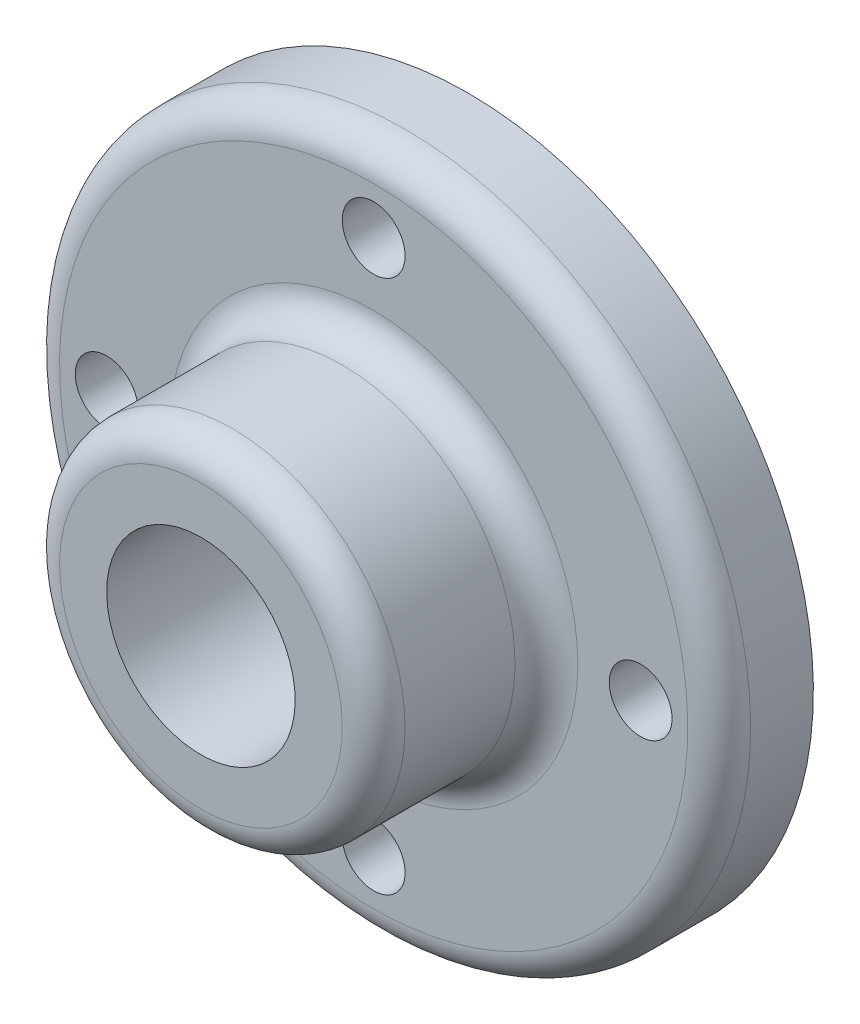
from build123d import *

# Parameters (mm, degrees)
SKETCH3_R          = 6.35
CUT_EXTRUDE1_DEPTH = 105.775000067
CIRPATTERN1_COUNT  = 4


with BuildPart() as part:
    # Sketch2 → Base-Revolve (revolve)
    with BuildSketch(Plane(origin=(0, 0, 0), x_dir=(0, 0, 1), z_dir=(1, 0, 0)), mode=Mode.PRIVATE) as base_revolve_sk:
        with BuildLine():
            Line((0, 69.85), (12.7, 69.85))
            ThreePointArc((12.7, 69.85), (17.190128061, 67.990128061), (19.05, 63.5))
            Line((19.05, 63.5), (19.05, 41.275))
            ThreePointArc((19.05, 41.275), (20.909871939, 36.784871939), (25.4, 34.925))
            Line((25.4, 34.925), (47.625, 34.925))
            ThreePointArc((47.625, 34.925), (52.115128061, 33.065128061), (53.975, 28.575))
            Line((53.975, 28.575), (53.975, 19.05))
            Line((53.975, 19.05), (0, 19.05))
            Line((0, 19.05), (0, 69.85))
        make_face()
    revolve(base_revolve_sk.sketch.rotate(Axis((0, 0, 0), (0, 0, 1)), 180), axis=Axis((0, 0, 0), (0, 0, 1)))

    # Sketch3 → Cut-Extrude1 (cut, through all)
    with BuildSketch(Plane.XY.offset(19.05)):
        with Locations((53.975, 0)):
            Circle(SKETCH3_R)
    cut_extrude1 = extrude(amount=-CUT_EXTRUDE1_DEPTH, mode=Mode.SUBTRACT)

    # CirPattern1: Cut-Extrude1 ×4 about axis
    cirpattern1_axis = Axis((0, 0, 0), (0, 0, 1))
    for i in range(1, CIRPATTERN1_COUNT):
        add(cut_extrude1.rotate(cirpattern1_axis, i * 360 / CIRPATTERN1_COUNT), mode=Mode.SUBTRACT)


solid = part.part
